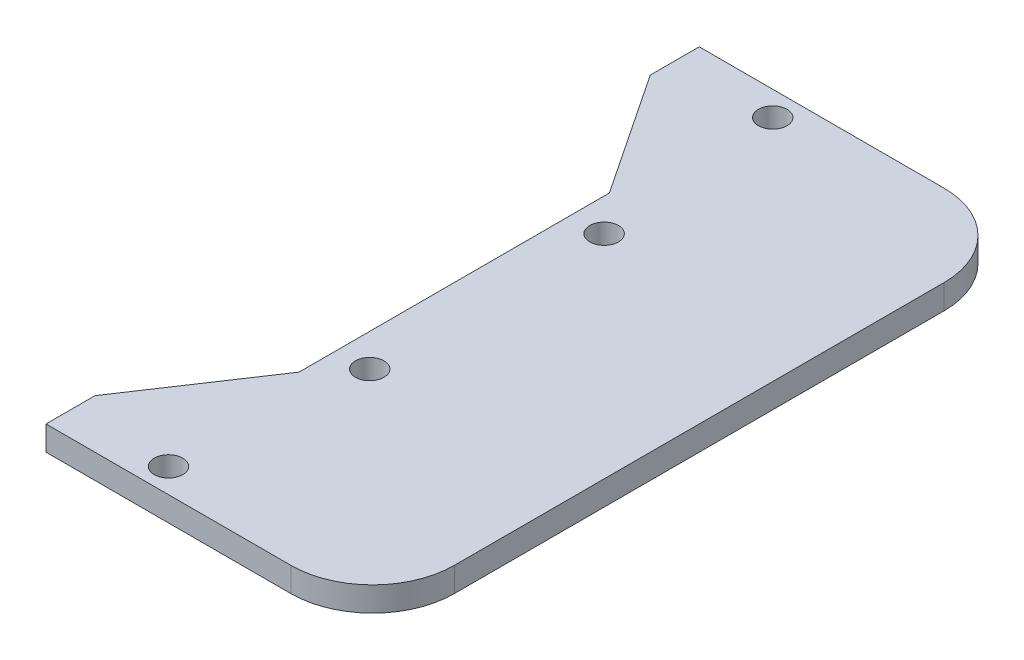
ISO-10303-21;
HEADER;
FILE_DESCRIPTION(('STEP AP214'),'2;1');
FILE_NAME('part.step','',(''),(''),'','','');
FILE_SCHEMA(('AUTOMOTIVE_DESIGN { 1 0 10303 214 1 1 1 1 }'));
ENDSEC;
DATA;
#1=APPLICATION_CONTEXT('core data for automotive mechanical design processes');
#2=APPLICATION_PROTOCOL_DEFINITION('international standard','automotive_design',2000,#1);
#3=PRODUCT_CONTEXT('',#1,'mechanical');
#4=PRODUCT('Part','Part','',(#3));
#5=PRODUCT_RELATED_PRODUCT_CATEGORY('part','',(#4));
#6=PRODUCT_DEFINITION_FORMATION('','',#4);
#7=PRODUCT_DEFINITION_CONTEXT('part definition',#1,'design');
#8=PRODUCT_DEFINITION('design','',#6,#7);
#9=PRODUCT_DEFINITION_SHAPE('','',#8);
#10=(LENGTH_UNIT() NAMED_UNIT(*) SI_UNIT(.MILLI.,.METRE.));
#11=(NAMED_UNIT(*) PLANE_ANGLE_UNIT() SI_UNIT($,.RADIAN.));
#12=(NAMED_UNIT(*) SI_UNIT($,.STERADIAN.) SOLID_ANGLE_UNIT());
#13=UNCERTAINTY_MEASURE_WITH_UNIT(LENGTH_MEASURE(1.E-05),#10,'distance_accuracy_value','');
#14=(GEOMETRIC_REPRESENTATION_CONTEXT(3) GLOBAL_UNCERTAINTY_ASSIGNED_CONTEXT((#13)) GLOBAL_UNIT_ASSIGNED_CONTEXT((#10,
#11,#12)) REPRESENTATION_CONTEXT('',''));
#15=CARTESIAN_POINT('',(0.,0.,0.));
#16=DIRECTION('',(0.,0.,1.));
#17=DIRECTION('',(1.,0.,0.));
#18=AXIS2_PLACEMENT_3D('',#15,#16,#17);
#19=CARTESIAN_POINT('',(20.,3.,30.));
#20=DIRECTION('',(0.,1.,0.));
#21=DIRECTION('',(0.,0.,1.));
#22=AXIS2_PLACEMENT_3D('',#19,#20,#21);
#23=PLANE('',#22);
#24=CARTESIAN_POINT('',(2.,3.,37.));
#25=DIRECTION('',(0.,1.,0.));
#26=DIRECTION('',(0.,0.,-1.));
#27=AXIS2_PLACEMENT_3D('',#24,#25,#26);
#28=CIRCLE('',#27,1.75);
#29=CARTESIAN_POINT('',(2.,3.,35.25));
#30=VERTEX_POINT('',#29);
#31=EDGE_CURVE('E260',#30,#30,#28,.T.);
#32=ORIENTED_EDGE('',*,*,#31,.F.);
#33=EDGE_LOOP('',(#32));
#34=FACE_BOUND('',#33,.T.);
#35=CARTESIAN_POINT('',(2.,3.,-37.));
#36=DIRECTION('',(0.,1.,0.));
#37=DIRECTION('',(0.,0.,1.));
#38=AXIS2_PLACEMENT_3D('',#35,#36,#37);
#39=CIRCLE('',#38,1.75);
#40=CARTESIAN_POINT('',(2.,3.,-35.25));
#41=VERTEX_POINT('',#40);
#42=EDGE_CURVE('E161',#41,#41,#39,.T.);
#43=ORIENTED_EDGE('',*,*,#42,.F.);
#44=EDGE_LOOP('',(#43));
#45=FACE_BOUND('',#44,.T.);
#46=DIRECTION('',(0.,0.,1.));
#47=VECTOR('',#46,1.);
#48=CARTESIAN_POINT('',(-10.,3.,-40.));
#49=LINE('',#48,#47);
#50=CARTESIAN_POINT('',(-10.,3.,-40.));
#51=VERTEX_POINT('',#50);
#52=CARTESIAN_POINT('',(-10.,3.,-34.));
#53=VERTEX_POINT('',#52);
#54=EDGE_CURVE('E185',#51,#53,#49,.T.);
#55=ORIENTED_EDGE('',*,*,#54,.T.);
#56=DIRECTION('',(0.554700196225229,0.,0.832050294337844));
#57=VECTOR('',#56,1.);
#58=CARTESIAN_POINT('',(-10.,3.,-34.));
#59=LINE('',#58,#57);
#60=CARTESIAN_POINT('',(0.,3.,-19.));
#61=VERTEX_POINT('',#60);
#62=EDGE_CURVE('E109',#53,#61,#59,.T.);
#63=ORIENTED_EDGE('',*,*,#62,.T.);
#64=DIRECTION('',(0.,0.,1.));
#65=VECTOR('',#64,1.);
#66=CARTESIAN_POINT('',(0.,3.,-19.));
#67=LINE('',#66,#65);
#68=CARTESIAN_POINT('',(0.,3.,19.));
#69=VERTEX_POINT('',#68);
#70=EDGE_CURVE('E214',#61,#69,#67,.T.);
#71=ORIENTED_EDGE('',*,*,#70,.T.);
#72=DIRECTION('',(-0.554700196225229,0.,0.832050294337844));
#73=VECTOR('',#72,1.);
#74=CARTESIAN_POINT('',(-10.,3.,34.));
#75=LINE('',#74,#73);
#76=CARTESIAN_POINT('',(-10.,3.,34.));
#77=VERTEX_POINT('',#76);
#78=EDGE_CURVE('E234',#69,#77,#75,.T.);
#79=ORIENTED_EDGE('',*,*,#78,.T.);
#80=DIRECTION('',(0.,0.,1.));
#81=VECTOR('',#80,1.);
#82=CARTESIAN_POINT('',(-10.,3.,40.));
#83=LINE('',#82,#81);
#84=CARTESIAN_POINT('',(-10.,3.,40.));
#85=VERTEX_POINT('',#84);
#86=EDGE_CURVE('E230',#77,#85,#83,.T.);
#87=ORIENTED_EDGE('',*,*,#86,.T.);
#88=DIRECTION('',(1.,0.,0.));
#89=VECTOR('',#88,1.);
#90=CARTESIAN_POINT('',(-10.,3.,40.));
#91=LINE('',#90,#89);
#92=CARTESIAN_POINT('',(19.9999999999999,3.,40.));
#93=VERTEX_POINT('',#92);
#94=EDGE_CURVE('E233',#85,#93,#91,.T.);
#95=ORIENTED_EDGE('',*,*,#94,.T.);
#96=CARTESIAN_POINT('',(20.,3.,30.));
#97=DIRECTION('',(0.,1.,0.));
#98=DIRECTION('',(0.,0.,1.));
#99=AXIS2_PLACEMENT_3D('',#96,#97,#98);
#100=CIRCLE('',#99,10.);
#101=CARTESIAN_POINT('',(30.,3.,29.9999999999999));
#102=VERTEX_POINT('',#101);
#103=EDGE_CURVE('E134',#93,#102,#100,.T.);
#104=ORIENTED_EDGE('',*,*,#103,.T.);
#105=DIRECTION('',(0.,0.,-1.));
#106=VECTOR('',#105,1.);
#107=CARTESIAN_POINT('',(30.,3.,-29.9999999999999));
#108=LINE('',#107,#106);
#109=CARTESIAN_POINT('',(30.,3.,-29.9999999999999));
#110=VERTEX_POINT('',#109);
#111=EDGE_CURVE('E128',#102,#110,#108,.T.);
#112=ORIENTED_EDGE('',*,*,#111,.T.);
#113=CARTESIAN_POINT('',(20.,3.,-30.));
#114=DIRECTION('',(0.,1.,0.));
#115=DIRECTION('',(0.,0.,-1.));
#116=AXIS2_PLACEMENT_3D('',#113,#114,#115);
#117=CIRCLE('',#116,10.);
#118=CARTESIAN_POINT('',(19.9999999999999,3.,-40.));
#119=VERTEX_POINT('',#118);
#120=EDGE_CURVE('E132',#110,#119,#117,.T.);
#121=ORIENTED_EDGE('',*,*,#120,.T.);
#122=DIRECTION('',(-1.,0.,0.));
#123=VECTOR('',#122,1.);
#124=CARTESIAN_POINT('',(-10.,3.,-40.));
#125=LINE('',#124,#123);
#126=EDGE_CURVE('E60',#119,#51,#125,.T.);
#127=ORIENTED_EDGE('',*,*,#126,.T.);
#128=EDGE_LOOP('',(#55,#63,#71,#79,#87,#95,#104,#112,#121,#127));
#129=FACE_BOUND('',#128,.T.);
#130=CARTESIAN_POINT('',(4.,3.,-14.355));
#131=DIRECTION('',(0.,1.,0.));
#132=DIRECTION('',(0.,0.,1.));
#133=AXIS2_PLACEMENT_3D('',#130,#131,#132);
#134=CIRCLE('',#133,1.75);
#135=CARTESIAN_POINT('',(4.,3.,-12.605));
#136=VERTEX_POINT('',#135);
#137=EDGE_CURVE('E252',#136,#136,#134,.T.);
#138=ORIENTED_EDGE('',*,*,#137,.F.);
#139=EDGE_LOOP('',(#138));
#140=FACE_BOUND('',#139,.T.);
#141=CARTESIAN_POINT('',(4.,3.,14.355));
#142=DIRECTION('',(0.,1.,0.));
#143=DIRECTION('',(0.,0.,-1.));
#144=AXIS2_PLACEMENT_3D('',#141,#142,#143);
#145=CIRCLE('',#144,1.75);
#146=CARTESIAN_POINT('',(4.,3.,12.605));
#147=VERTEX_POINT('',#146);
#148=EDGE_CURVE('E268',#147,#147,#145,.T.);
#149=ORIENTED_EDGE('',*,*,#148,.F.);
#150=EDGE_LOOP('',(#149));
#151=FACE_BOUND('',#150,.T.);
#152=ADVANCED_FACE('F42',(#34,#45,#129,#140,#151),#23,.T.);
#153=CARTESIAN_POINT('',(20.,0.,30.));
#154=DIRECTION('',(0.,1.,0.));
#155=DIRECTION('',(0.,0.,1.));
#156=AXIS2_PLACEMENT_3D('',#153,#154,#155);
#157=PLANE('',#156);
#158=DIRECTION('',(0.,0.,1.));
#159=VECTOR('',#158,1.);
#160=CARTESIAN_POINT('',(-10.,0.,-40.));
#161=LINE('',#160,#159);
#162=CARTESIAN_POINT('',(-10.,0.,-40.));
#163=VERTEX_POINT('',#162);
#164=CARTESIAN_POINT('',(-10.,0.,-34.));
#165=VERTEX_POINT('',#164);
#166=EDGE_CURVE('E156',#163,#165,#161,.T.);
#167=ORIENTED_EDGE('',*,*,#166,.F.);
#168=DIRECTION('',(-1.,0.,0.));
#169=VECTOR('',#168,1.);
#170=CARTESIAN_POINT('',(-10.,0.,-40.));
#171=LINE('',#170,#169);
#172=CARTESIAN_POINT('',(19.9999999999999,0.,-40.));
#173=VERTEX_POINT('',#172);
#174=EDGE_CURVE('E101',#173,#163,#171,.T.);
#175=ORIENTED_EDGE('',*,*,#174,.F.);
#176=CARTESIAN_POINT('',(20.,0.,-30.));
#177=DIRECTION('',(0.,1.,0.));
#178=DIRECTION('',(0.,0.,-1.));
#179=AXIS2_PLACEMENT_3D('',#176,#177,#178);
#180=CIRCLE('',#179,10.);
#181=CARTESIAN_POINT('',(30.,0.,-29.9999999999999));
#182=VERTEX_POINT('',#181);
#183=EDGE_CURVE('E95',#182,#173,#180,.T.);
#184=ORIENTED_EDGE('',*,*,#183,.F.);
#185=DIRECTION('',(0.,0.,-1.));
#186=VECTOR('',#185,1.);
#187=CARTESIAN_POINT('',(30.,0.,-29.9999999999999));
#188=LINE('',#187,#186);
#189=CARTESIAN_POINT('',(30.,0.,29.9999999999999));
#190=VERTEX_POINT('',#189);
#191=EDGE_CURVE('E143',#190,#182,#188,.T.);
#192=ORIENTED_EDGE('',*,*,#191,.F.);
#193=CARTESIAN_POINT('',(20.,0.,30.));
#194=DIRECTION('',(0.,1.,0.));
#195=DIRECTION('',(0.,0.,1.));
#196=AXIS2_PLACEMENT_3D('',#193,#194,#195);
#197=CIRCLE('',#196,10.);
#198=CARTESIAN_POINT('',(19.9999999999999,0.,40.));
#199=VERTEX_POINT('',#198);
#200=EDGE_CURVE('E176',#199,#190,#197,.T.);
#201=ORIENTED_EDGE('',*,*,#200,.F.);
#202=DIRECTION('',(1.,0.,0.));
#203=VECTOR('',#202,1.);
#204=CARTESIAN_POINT('',(-10.,0.,40.));
#205=LINE('',#204,#203);
#206=CARTESIAN_POINT('',(-10.,0.,40.));
#207=VERTEX_POINT('',#206);
#208=EDGE_CURVE('E173',#207,#199,#205,.T.);
#209=ORIENTED_EDGE('',*,*,#208,.F.);
#210=DIRECTION('',(0.,0.,1.));
#211=VECTOR('',#210,1.);
#212=CARTESIAN_POINT('',(-10.,0.,40.));
#213=LINE('',#212,#211);
#214=CARTESIAN_POINT('',(-10.,0.,34.));
#215=VERTEX_POINT('',#214);
#216=EDGE_CURVE('E170',#215,#207,#213,.T.);
#217=ORIENTED_EDGE('',*,*,#216,.F.);
#218=DIRECTION('',(-0.554700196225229,0.,0.832050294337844));
#219=VECTOR('',#218,1.);
#220=CARTESIAN_POINT('',(-10.,0.,34.));
#221=LINE('',#220,#219);
#222=CARTESIAN_POINT('',(0.,0.,19.));
#223=VERTEX_POINT('',#222);
#224=EDGE_CURVE('E167',#223,#215,#221,.T.);
#225=ORIENTED_EDGE('',*,*,#224,.F.);
#226=DIRECTION('',(0.,0.,1.));
#227=VECTOR('',#226,1.);
#228=CARTESIAN_POINT('',(0.,0.,-19.));
#229=LINE('',#228,#227);
#230=CARTESIAN_POINT('',(0.,0.,-19.));
#231=VERTEX_POINT('',#230);
#232=EDGE_CURVE('E164',#231,#223,#229,.T.);
#233=ORIENTED_EDGE('',*,*,#232,.F.);
#234=DIRECTION('',(0.554700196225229,0.,0.832050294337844));
#235=VECTOR('',#234,1.);
#236=CARTESIAN_POINT('',(-10.,0.,-34.));
#237=LINE('',#236,#235);
#238=EDGE_CURVE('E160',#165,#231,#237,.T.);
#239=ORIENTED_EDGE('',*,*,#238,.F.);
#240=EDGE_LOOP('',(#167,#175,#184,#192,#201,#209,#217,#225,#233,#239));
#241=FACE_BOUND('',#240,.T.);
#242=CARTESIAN_POINT('',(2.,0.,-37.));
#243=DIRECTION('',(0.,1.,0.));
#244=DIRECTION('',(0.,0.,1.));
#245=AXIS2_PLACEMENT_3D('',#242,#243,#244);
#246=CIRCLE('',#245,1.75);
#247=CARTESIAN_POINT('',(2.,0.,-35.25));
#248=VERTEX_POINT('',#247);
#249=EDGE_CURVE('E248',#248,#248,#246,.T.);
#250=ORIENTED_EDGE('',*,*,#249,.T.);
#251=EDGE_LOOP('',(#250));
#252=FACE_BOUND('',#251,.T.);
#253=CARTESIAN_POINT('',(4.,0.,-14.355));
#254=DIRECTION('',(0.,1.,0.));
#255=DIRECTION('',(0.,0.,1.));
#256=AXIS2_PLACEMENT_3D('',#253,#254,#255);
#257=CIRCLE('',#256,1.75);
#258=CARTESIAN_POINT('',(4.,0.,-12.605));
#259=VERTEX_POINT('',#258);
#260=EDGE_CURVE('E256',#259,#259,#257,.T.);
#261=ORIENTED_EDGE('',*,*,#260,.T.);
#262=EDGE_LOOP('',(#261));
#263=FACE_BOUND('',#262,.T.);
#264=CARTESIAN_POINT('',(2.,0.,37.));
#265=DIRECTION('',(0.,1.,0.));
#266=DIRECTION('',(0.,0.,-1.));
#267=AXIS2_PLACEMENT_3D('',#264,#265,#266);
#268=CIRCLE('',#267,1.75);
#269=CARTESIAN_POINT('',(2.,0.,35.25));
#270=VERTEX_POINT('',#269);
#271=EDGE_CURVE('E264',#270,#270,#268,.T.);
#272=ORIENTED_EDGE('',*,*,#271,.T.);
#273=EDGE_LOOP('',(#272));
#274=FACE_BOUND('',#273,.T.);
#275=CARTESIAN_POINT('',(4.,0.,14.355));
#276=DIRECTION('',(0.,1.,0.));
#277=DIRECTION('',(0.,0.,-1.));
#278=AXIS2_PLACEMENT_3D('',#275,#276,#277);
#279=CIRCLE('',#278,1.75);
#280=CARTESIAN_POINT('',(4.,0.,12.605));
#281=VERTEX_POINT('',#280);
#282=EDGE_CURVE('E272',#281,#281,#279,.T.);
#283=ORIENTED_EDGE('',*,*,#282,.T.);
#284=EDGE_LOOP('',(#283));
#285=FACE_BOUND('',#284,.T.);
#286=ADVANCED_FACE('F218',(#241,#252,#263,#274,#285),#157,.F.);
#287=CARTESIAN_POINT('',(-10.,3.,-40.));
#288=DIRECTION('',(1.,0.,0.));
#289=DIRECTION('',(0.,0.,-1.));
#290=AXIS2_PLACEMENT_3D('',#287,#288,#289);
#291=PLANE('',#290);
#292=ORIENTED_EDGE('',*,*,#166,.T.);
#293=DIRECTION('',(0.,-1.,0.));
#294=VECTOR('',#293,1.);
#295=CARTESIAN_POINT('',(-10.,3.,-34.));
#296=LINE('',#295,#294);
#297=EDGE_CURVE('E11',#53,#165,#296,.T.);
#298=ORIENTED_EDGE('',*,*,#297,.F.);
#299=ORIENTED_EDGE('',*,*,#54,.F.);
#300=DIRECTION('',(0.,-1.,0.));
#301=VECTOR('',#300,1.);
#302=CARTESIAN_POINT('',(-10.,3.,-40.));
#303=LINE('',#302,#301);
#304=EDGE_CURVE('E152',#51,#163,#303,.T.);
#305=ORIENTED_EDGE('',*,*,#304,.T.);
#306=EDGE_LOOP('',(#292,#298,#299,#305));
#307=FACE_BOUND('',#306,.T.);
#308=ADVANCED_FACE('F44',(#307),#291,.F.);
#309=CARTESIAN_POINT('',(-10.,3.,-34.));
#310=DIRECTION('',(0.832050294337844,0.,-0.554700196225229));
#311=DIRECTION('',(-0.554700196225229,0.,-0.832050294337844));
#312=AXIS2_PLACEMENT_3D('',#309,#310,#311);
#313=PLANE('',#312);
#314=ORIENTED_EDGE('',*,*,#238,.T.);
#315=DIRECTION('',(0.,-1.,0.));
#316=VECTOR('',#315,1.);
#317=CARTESIAN_POINT('',(0.,3.,-19.));
#318=LINE('',#317,#316);
#319=EDGE_CURVE('E52',#61,#231,#318,.T.);
#320=ORIENTED_EDGE('',*,*,#319,.F.);
#321=ORIENTED_EDGE('',*,*,#62,.F.);
#322=ORIENTED_EDGE('',*,*,#297,.T.);
#323=EDGE_LOOP('',(#314,#320,#321,#322));
#324=FACE_BOUND('',#323,.T.);
#325=ADVANCED_FACE('F316',(#324),#313,.F.);
#326=CARTESIAN_POINT('',(0.,3.,-19.));
#327=DIRECTION('',(1.,0.,0.));
#328=DIRECTION('',(0.,0.,-1.));
#329=AXIS2_PLACEMENT_3D('',#326,#327,#328);
#330=PLANE('',#329);
#331=ORIENTED_EDGE('',*,*,#232,.T.);
#332=DIRECTION('',(0.,-1.,0.));
#333=VECTOR('',#332,1.);
#334=CARTESIAN_POINT('',(0.,3.,19.));
#335=LINE('',#334,#333);
#336=EDGE_CURVE('E204',#69,#223,#335,.T.);
#337=ORIENTED_EDGE('',*,*,#336,.F.);
#338=ORIENTED_EDGE('',*,*,#70,.F.);
#339=ORIENTED_EDGE('',*,*,#319,.T.);
#340=EDGE_LOOP('',(#331,#337,#338,#339));
#341=FACE_BOUND('',#340,.T.);
#342=ADVANCED_FACE('F212',(#341),#330,.F.);
#343=CARTESIAN_POINT('',(-10.,3.,34.));
#344=DIRECTION('',(0.832050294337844,0.,0.554700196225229));
#345=DIRECTION('',(0.554700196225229,0.,-0.832050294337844));
#346=AXIS2_PLACEMENT_3D('',#343,#344,#345);
#347=PLANE('',#346);
#348=ORIENTED_EDGE('',*,*,#224,.T.);
#349=DIRECTION('',(0.,-1.,0.));
#350=VECTOR('',#349,1.);
#351=CARTESIAN_POINT('',(-10.,3.,34.));
#352=LINE('',#351,#350);
#353=EDGE_CURVE('E200',#77,#215,#352,.T.);
#354=ORIENTED_EDGE('',*,*,#353,.F.);
#355=ORIENTED_EDGE('',*,*,#78,.F.);
#356=ORIENTED_EDGE('',*,*,#336,.T.);
#357=EDGE_LOOP('',(#348,#354,#355,#356));
#358=FACE_BOUND('',#357,.T.);
#359=ADVANCED_FACE('F224',(#358),#347,.F.);
#360=CARTESIAN_POINT('',(-10.,3.,40.));
#361=DIRECTION('',(1.,0.,0.));
#362=DIRECTION('',(0.,0.,-1.));
#363=AXIS2_PLACEMENT_3D('',#360,#361,#362);
#364=PLANE('',#363);
#365=ORIENTED_EDGE('',*,*,#216,.T.);
#366=DIRECTION('',(0.,-1.,0.));
#367=VECTOR('',#366,1.);
#368=CARTESIAN_POINT('',(-10.,3.,40.));
#369=LINE('',#368,#367);
#370=EDGE_CURVE('E196',#85,#207,#369,.T.);
#371=ORIENTED_EDGE('',*,*,#370,.F.);
#372=ORIENTED_EDGE('',*,*,#86,.F.);
#373=ORIENTED_EDGE('',*,*,#353,.T.);
#374=EDGE_LOOP('',(#365,#371,#372,#373));
#375=FACE_BOUND('',#374,.T.);
#376=ADVANCED_FACE('F228',(#375),#364,.F.);
#377=CARTESIAN_POINT('',(-10.,3.,40.));
#378=DIRECTION('',(0.,0.,-1.));
#379=DIRECTION('',(-1.,0.,0.));
#380=AXIS2_PLACEMENT_3D('',#377,#378,#379);
#381=PLANE('',#380);
#382=ORIENTED_EDGE('',*,*,#208,.T.);
#383=DIRECTION('',(0.,-1.,0.));
#384=VECTOR('',#383,1.);
#385=CARTESIAN_POINT('',(19.9999999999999,3.,40.));
#386=LINE('',#385,#384);
#387=EDGE_CURVE('E192',#93,#199,#386,.T.);
#388=ORIENTED_EDGE('',*,*,#387,.F.);
#389=ORIENTED_EDGE('',*,*,#94,.F.);
#390=ORIENTED_EDGE('',*,*,#370,.T.);
#391=EDGE_LOOP('',(#382,#388,#389,#390));
#392=FACE_BOUND('',#391,.T.);
#393=ADVANCED_FACE('F306',(#392),#381,.F.);
#394=CARTESIAN_POINT('',(20.,3.,30.));
#395=DIRECTION('',(0.,-1.,0.));
#396=DIRECTION('',(0.,0.,-1.));
#397=AXIS2_PLACEMENT_3D('',#394,#395,#396);
#398=CYLINDRICAL_SURFACE('',#397,10.);
#399=ORIENTED_EDGE('',*,*,#200,.T.);
#400=DIRECTION('',(0.,-1.,0.));
#401=VECTOR('',#400,1.);
#402=CARTESIAN_POINT('',(30.,3.,29.9999999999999));
#403=LINE('',#402,#401);
#404=EDGE_CURVE('E145',#102,#190,#403,.T.);
#405=ORIENTED_EDGE('',*,*,#404,.F.);
#406=ORIENTED_EDGE('',*,*,#103,.F.);
#407=ORIENTED_EDGE('',*,*,#387,.T.);
#408=EDGE_LOOP('',(#399,#405,#406,#407));
#409=FACE_BOUND('',#408,.T.);
#410=ADVANCED_FACE('F303',(#409),#398,.T.);
#411=CARTESIAN_POINT('',(30.,3.,-29.9999999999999));
#412=DIRECTION('',(-1.,0.,0.));
#413=DIRECTION('',(0.,0.,1.));
#414=AXIS2_PLACEMENT_3D('',#411,#412,#413);
#415=PLANE('',#414);
#416=ORIENTED_EDGE('',*,*,#191,.T.);
#417=DIRECTION('',(0.,-1.,0.));
#418=VECTOR('',#417,1.);
#419=CARTESIAN_POINT('',(30.,3.,-29.9999999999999));
#420=LINE('',#419,#418);
#421=EDGE_CURVE('E140',#110,#182,#420,.T.);
#422=ORIENTED_EDGE('',*,*,#421,.F.);
#423=ORIENTED_EDGE('',*,*,#111,.F.);
#424=ORIENTED_EDGE('',*,*,#404,.T.);
#425=EDGE_LOOP('',(#416,#422,#423,#424));
#426=FACE_BOUND('',#425,.T.);
#427=ADVANCED_FACE('F141',(#426),#415,.F.);
#428=CARTESIAN_POINT('',(20.,3.,-30.));
#429=DIRECTION('',(0.,-1.,0.));
#430=DIRECTION('',(0.,0.,-1.));
#431=AXIS2_PLACEMENT_3D('',#428,#429,#430);
#432=CYLINDRICAL_SURFACE('',#431,10.);
#433=ORIENTED_EDGE('',*,*,#183,.T.);
#434=DIRECTION('',(0.,-1.,0.));
#435=VECTOR('',#434,1.);
#436=CARTESIAN_POINT('',(19.9999999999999,3.,-40.));
#437=LINE('',#436,#435);
#438=EDGE_CURVE('E146',#119,#173,#437,.T.);
#439=ORIENTED_EDGE('',*,*,#438,.F.);
#440=ORIENTED_EDGE('',*,*,#120,.F.);
#441=ORIENTED_EDGE('',*,*,#421,.T.);
#442=EDGE_LOOP('',(#433,#439,#440,#441));
#443=FACE_BOUND('',#442,.T.);
#444=ADVANCED_FACE('F148',(#443),#432,.T.);
#445=CARTESIAN_POINT('',(-10.,3.,-40.));
#446=DIRECTION('',(0.,0.,1.));
#447=DIRECTION('',(1.,0.,0.));
#448=AXIS2_PLACEMENT_3D('',#445,#446,#447);
#449=PLANE('',#448);
#450=ORIENTED_EDGE('',*,*,#174,.T.);
#451=ORIENTED_EDGE('',*,*,#304,.F.);
#452=ORIENTED_EDGE('',*,*,#126,.F.);
#453=ORIENTED_EDGE('',*,*,#438,.T.);
#454=EDGE_LOOP('',(#450,#451,#452,#453));
#455=FACE_BOUND('',#454,.T.);
#456=ADVANCED_FACE('F296',(#455),#449,.F.);
#457=CARTESIAN_POINT('',(2.,3.,-37.));
#458=DIRECTION('',(0.,-1.,0.));
#459=DIRECTION('',(0.,0.,-1.));
#460=AXIS2_PLACEMENT_3D('',#457,#458,#459);
#461=CYLINDRICAL_SURFACE('',#460,1.75);
#462=ORIENTED_EDGE('',*,*,#42,.T.);
#463=EDGE_LOOP('',(#462));
#464=FACE_BOUND('',#463,.T.);
#465=ORIENTED_EDGE('',*,*,#249,.F.);
#466=EDGE_LOOP('',(#465));
#467=FACE_BOUND('',#466,.T.);
#468=ADVANCED_FACE('F293',(#464,#467),#461,.F.);
#469=CARTESIAN_POINT('',(4.,3.,-14.355));
#470=DIRECTION('',(0.,-1.,0.));
#471=DIRECTION('',(0.,0.,-1.));
#472=AXIS2_PLACEMENT_3D('',#469,#470,#471);
#473=CYLINDRICAL_SURFACE('',#472,1.75);
#474=ORIENTED_EDGE('',*,*,#137,.T.);
#475=EDGE_LOOP('',(#474));
#476=FACE_BOUND('',#475,.T.);
#477=ORIENTED_EDGE('',*,*,#260,.F.);
#478=EDGE_LOOP('',(#477));
#479=FACE_BOUND('',#478,.T.);
#480=ADVANCED_FACE('F406',(#476,#479),#473,.F.);
#481=CARTESIAN_POINT('',(2.,3.,37.));
#482=DIRECTION('',(0.,-1.,0.));
#483=DIRECTION('',(0.,0.,-1.));
#484=AXIS2_PLACEMENT_3D('',#481,#482,#483);
#485=CYLINDRICAL_SURFACE('',#484,1.75);
#486=ORIENTED_EDGE('',*,*,#31,.T.);
#487=EDGE_LOOP('',(#486));
#488=FACE_BOUND('',#487,.T.);
#489=ORIENTED_EDGE('',*,*,#271,.F.);
#490=EDGE_LOOP('',(#489));
#491=FACE_BOUND('',#490,.T.);
#492=ADVANCED_FACE('F415',(#488,#491),#485,.F.);
#493=CARTESIAN_POINT('',(4.,3.,14.355));
#494=DIRECTION('',(0.,-1.,0.));
#495=DIRECTION('',(0.,0.,-1.));
#496=AXIS2_PLACEMENT_3D('',#493,#494,#495);
#497=CYLINDRICAL_SURFACE('',#496,1.75);
#498=ORIENTED_EDGE('',*,*,#148,.T.);
#499=EDGE_LOOP('',(#498));
#500=FACE_BOUND('',#499,.T.);
#501=ORIENTED_EDGE('',*,*,#282,.F.);
#502=EDGE_LOOP('',(#501));
#503=FACE_BOUND('',#502,.T.);
#504=ADVANCED_FACE('F280',(#500,#503),#497,.F.);
#505=CLOSED_SHELL('',(#152,#286,#308,#325,#342,#359,#376,#393,#410,#427,#444,#456,#468,#480,
#492,#504));
#506=MANIFOLD_SOLID_BREP('B2',#505);
#507=ADVANCED_BREP_SHAPE_REPRESENTATION('',(#18,#506),#14);
#508=SHAPE_DEFINITION_REPRESENTATION(#9,#507);
ENDSEC;
END-ISO-10303-21;
